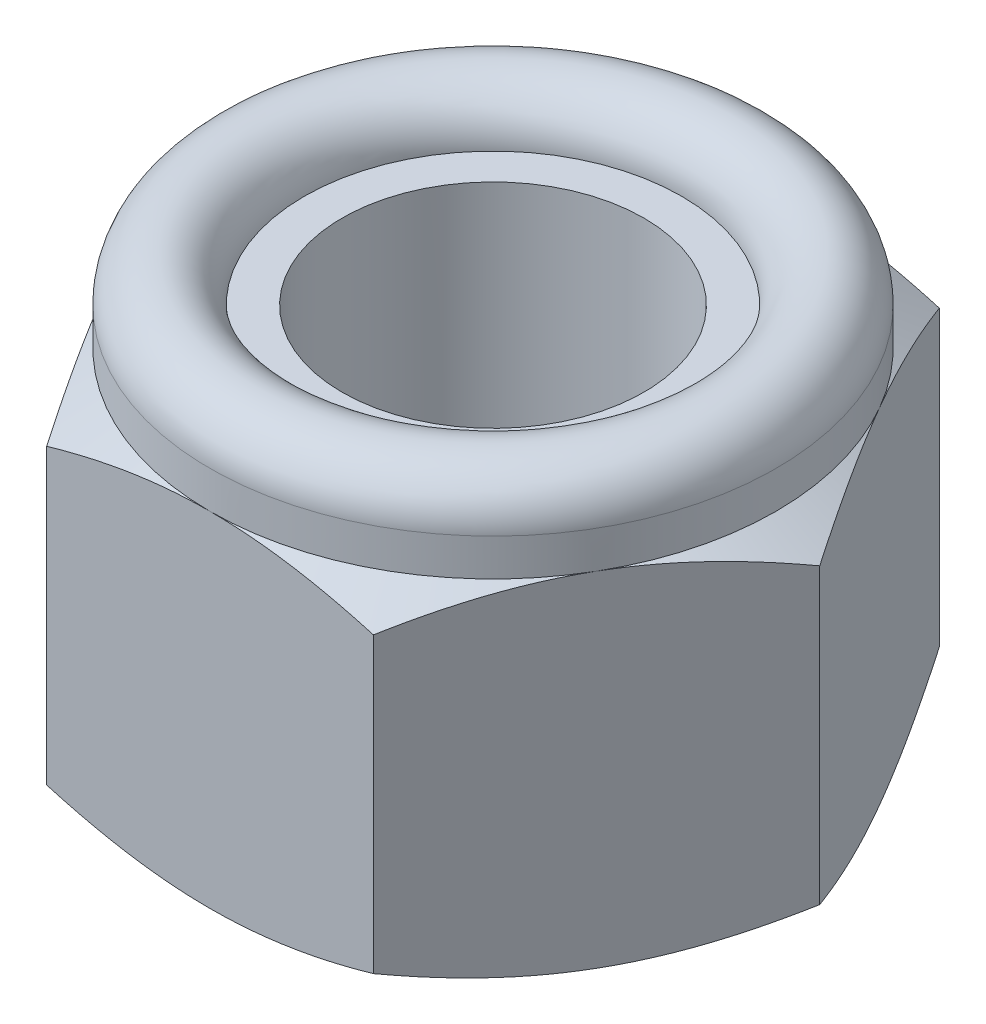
ISO-10303-21;
HEADER;
FILE_DESCRIPTION(('STEP AP214'),'2;1');
FILE_NAME('part.step','',(''),(''),'','','');
FILE_SCHEMA(('AUTOMOTIVE_DESIGN { 1 0 10303 214 1 1 1 1 }'));
ENDSEC;
DATA;
#1=APPLICATION_CONTEXT('core data for automotive mechanical design processes');
#2=APPLICATION_PROTOCOL_DEFINITION('international standard','automotive_design',2000,#1);
#3=PRODUCT_CONTEXT('',#1,'mechanical');
#4=PRODUCT('Part','Part','',(#3));
#5=PRODUCT_RELATED_PRODUCT_CATEGORY('part','',(#4));
#6=PRODUCT_DEFINITION_FORMATION('','',#4);
#7=PRODUCT_DEFINITION_CONTEXT('part definition',#1,'design');
#8=PRODUCT_DEFINITION('design','',#6,#7);
#9=PRODUCT_DEFINITION_SHAPE('','',#8);
#10=(LENGTH_UNIT() NAMED_UNIT(*) SI_UNIT(.MILLI.,.METRE.));
#11=(NAMED_UNIT(*) PLANE_ANGLE_UNIT() SI_UNIT($,.RADIAN.));
#12=(NAMED_UNIT(*) SI_UNIT($,.STERADIAN.) SOLID_ANGLE_UNIT());
#13=UNCERTAINTY_MEASURE_WITH_UNIT(LENGTH_MEASURE(1.E-05),#10,'distance_accuracy_value','');
#14=(GEOMETRIC_REPRESENTATION_CONTEXT(3) GLOBAL_UNCERTAINTY_ASSIGNED_CONTEXT((#13)) GLOBAL_UNIT_ASSIGNED_CONTEXT((#10,
#11,#12)) REPRESENTATION_CONTEXT('',''));
#15=CARTESIAN_POINT('',(0.,0.,0.));
#16=DIRECTION('',(0.,0.,1.));
#17=DIRECTION('',(1.,0.,0.));
#18=AXIS2_PLACEMENT_3D('',#15,#16,#17);
#19=CARTESIAN_POINT('',(0.,0.,0.));
#20=DIRECTION('',(0.,1.,0.));
#21=DIRECTION('',(0.,0.,1.));
#22=AXIS2_PLACEMENT_3D('',#19,#20,#21);
#23=CONICAL_SURFACE('',#22,15.0000000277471,1.04719754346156);
#24=CARTESIAN_POINT('',(17.3206235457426,1.33981263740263,0.0002));
#25=CARTESIAN_POINT('',(17.1302745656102,1.22992179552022,-0.329494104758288));
#26=CARTESIAN_POINT('',(16.9391831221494,1.12501759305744,-0.660474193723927));
#27=CARTESIAN_POINT('',(16.5554679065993,0.926568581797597,-1.32508844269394));
#28=CARTESIAN_POINT('',(16.3628436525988,0.833027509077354,-1.65872343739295));
#29=CARTESIAN_POINT('',(15.975690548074,0.658562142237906,-2.32929228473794));
#30=CARTESIAN_POINT('',(15.781158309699,0.57766769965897,-2.66623200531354));
#31=CARTESIAN_POINT('',(15.3907420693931,0.430232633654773,-3.34245276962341));
#32=CARTESIAN_POINT('',(15.194858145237,0.363691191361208,-3.6817336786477));
#33=CARTESIAN_POINT('',(14.8067578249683,0.247792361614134,-4.3539431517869));
#34=CARTESIAN_POINT('',(14.6145702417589,0.198051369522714,-4.68682181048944));
#35=CARTESIAN_POINT('',(14.229314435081,0.114646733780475,-5.35410444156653));
#36=CARTESIAN_POINT('',(14.0362461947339,0.0809833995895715,-5.68850844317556));
#37=CARTESIAN_POINT('',(13.6497853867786,0.0305840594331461,-6.35787819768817));
#38=CARTESIAN_POINT('',(13.4563934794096,0.0138279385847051,-6.692842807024));
#39=CARTESIAN_POINT('',(13.0694311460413,-0.0023966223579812,-7.36308122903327));
#40=CARTESIAN_POINT('',(12.875860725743,-0.00186559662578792,-7.69835503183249));
#41=CARTESIAN_POINT('',(12.513982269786,0.0152765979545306,-8.3251469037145));
#42=CARTESIAN_POINT('',(12.3456484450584,0.0297968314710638,-8.61670964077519));
#43=CARTESIAN_POINT('',(12.0093680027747,0.0716371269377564,-9.19916445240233));
#44=CARTESIAN_POINT('',(11.8414214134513,0.098958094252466,-9.49005647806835));
#45=CARTESIAN_POINT('',(11.5060066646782,0.165923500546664,-10.0710118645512));
#46=CARTESIAN_POINT('',(11.3385390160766,0.205578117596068,-10.3610743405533));
#47=CARTESIAN_POINT('',(11.0043888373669,0.296515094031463,-10.9398394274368));
#48=CARTESIAN_POINT('',(10.8377063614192,0.347798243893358,-11.2285419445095));
#49=CARTESIAN_POINT('',(10.3317324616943,0.520386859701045,-12.1049144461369));
#50=CARTESIAN_POINT('',(9.99390625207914,0.658901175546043,-12.6900466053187));
#51=CARTESIAN_POINT('',(9.32329121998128,0.97327197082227,-13.8515859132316));
#52=CARTESIAN_POINT('',(8.99049381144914,1.14905461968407,-14.4280079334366));
#53=CARTESIAN_POINT('',(8.66013856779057,1.33981263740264,-15.0002));
#54=B_SPLINE_CURVE_WITH_KNOTS('',3,(#24,#25,#26,#27,#28,#29,#30,#31,#32,#33,#34,#35,#36,#37,#38,
#39,#40,#41,#42,#43,#44,#45,#46,#47,#48,#49,#50,#51,#52,#53),.UNSPECIFIED.,.F.,.F.,(4,2,2,2,2,2,
2,2,2,2,2,2,2,2,4),(0.,1.18875411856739,2.37789803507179,3.56980779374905,4.76164953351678,
5.92407381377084,7.08652046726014,8.24758249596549,9.40860864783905,10.4193068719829,
11.4300765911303,12.4416826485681,13.4533574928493,15.5211962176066,17.5849760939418),.UNSPECIFIED.);
#55=CARTESIAN_POINT('',(17.3205080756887,1.33974597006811,0.));
#56=VERTEX_POINT('',#55);
#57=CARTESIAN_POINT('',(12.9903810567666,0.,-7.49999999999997));
#58=VERTEX_POINT('',#57);
#59=EDGE_CURVE('E240',#56,#58,#54,.T.);
#60=ORIENTED_EDGE('',*,*,#59,.F.);
#61=CARTESIAN_POINT('',(8.66013856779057,1.33981263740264,15.0002));
#62=CARTESIAN_POINT('',(8.850487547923,1.22992179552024,14.6705058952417));
#63=CARTESIAN_POINT('',(9.04157899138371,1.12501759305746,14.3395258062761));
#64=CARTESIAN_POINT('',(9.42529420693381,0.926568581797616,13.6749115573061));
#65=CARTESIAN_POINT('',(9.61791846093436,0.833027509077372,13.341276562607));
#66=CARTESIAN_POINT('',(10.0050715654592,0.658562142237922,12.6707077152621));
#67=CARTESIAN_POINT('',(10.1996038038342,0.577667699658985,12.3337679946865));
#68=CARTESIAN_POINT('',(10.5900200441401,0.430232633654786,11.6575472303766));
#69=CARTESIAN_POINT('',(10.7859039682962,0.363691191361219,11.3182663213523));
#70=CARTESIAN_POINT('',(11.1740042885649,0.247792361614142,10.6460568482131));
#71=CARTESIAN_POINT('',(11.3661918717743,0.198051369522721,10.3131781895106));
#72=CARTESIAN_POINT('',(11.7514476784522,0.114646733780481,9.64589555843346));
#73=CARTESIAN_POINT('',(11.9445159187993,0.0809833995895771,9.31149155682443));
#74=CARTESIAN_POINT('',(12.3309767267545,0.03058405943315,8.64212180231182));
#75=CARTESIAN_POINT('',(12.5243686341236,0.0138279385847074,8.30715719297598));
#76=CARTESIAN_POINT('',(12.9113309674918,-0.00239662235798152,7.63691877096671));
#77=CARTESIAN_POINT('',(13.1049013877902,-0.00186559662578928,7.30164496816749));
#78=CARTESIAN_POINT('',(13.4667798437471,0.0152765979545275,6.67485309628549));
#79=CARTESIAN_POINT('',(13.6351136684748,0.0297968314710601,6.3832903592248));
#80=CARTESIAN_POINT('',(13.9713941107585,0.0716371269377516,5.80083554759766));
#81=CARTESIAN_POINT('',(14.1393407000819,0.0989580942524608,5.50994352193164));
#82=CARTESIAN_POINT('',(14.474755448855,0.165923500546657,4.92898813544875));
#83=CARTESIAN_POINT('',(14.6422230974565,0.20557811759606,4.63892565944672));
#84=CARTESIAN_POINT('',(14.9763732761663,0.296515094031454,4.0601605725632));
#85=CARTESIAN_POINT('',(15.1430557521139,0.347798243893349,3.77145805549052));
#86=CARTESIAN_POINT('',(15.6490296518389,0.520386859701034,2.8950855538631));
#87=CARTESIAN_POINT('',(15.986855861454,0.658901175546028,2.30995339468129));
#88=CARTESIAN_POINT('',(16.6574708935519,0.97327197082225,1.14841408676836));
#89=CARTESIAN_POINT('',(16.990268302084,1.14905461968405,0.571992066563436));
#90=CARTESIAN_POINT('',(17.3206235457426,1.33981263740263,-0.000199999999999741));
#91=B_SPLINE_CURVE_WITH_KNOTS('',3,(#61,#62,#63,#64,#65,#66,#67,#68,#69,#70,#71,#72,#73,#74,#75,
#76,#77,#78,#79,#80,#81,#82,#83,#84,#85,#86,#87,#88,#89,#90),.UNSPECIFIED.,.F.,.F.,(4,2,2,2,2,2,
2,2,2,2,2,2,2,2,4),(0.,1.18875411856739,2.3778980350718,3.56980779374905,4.76164953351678,
5.92407381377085,7.08652046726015,8.24758249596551,9.40860864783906,10.4193068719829,
11.4300765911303,12.4416826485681,13.4533574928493,15.5211962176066,17.5849760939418),.UNSPECIFIED.);
#92=CARTESIAN_POINT('',(12.9903810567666,0.,7.49999999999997));
#93=VERTEX_POINT('',#92);
#94=EDGE_CURVE('E155',#93,#56,#91,.T.);
#95=ORIENTED_EDGE('',*,*,#94,.F.);
#96=CARTESIAN_POINT('',(0.,0.,0.));
#97=DIRECTION('',(0.,-1.,0.));
#98=DIRECTION('',(0.,0.,-1.));
#99=AXIS2_PLACEMENT_3D('',#96,#97,#98);
#100=CIRCLE('',#99,15.0000000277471);
#101=EDGE_CURVE('E253',#58,#93,#100,.T.);
#102=ORIENTED_EDGE('',*,*,#101,.F.);
#103=EDGE_LOOP('',(#60,#95,#102));
#104=FACE_BOUND('',#103,.T.);
#105=ADVANCED_FACE('F37',(#104),#23,.T.);
#106=CARTESIAN_POINT('',(8.66025403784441,1.33974597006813,-15.));
#107=VERTEX_POINT('',#106);
#108=EDGE_CURVE('E235',#58,#107,#54,.T.);
#109=ORIENTED_EDGE('',*,*,#108,.F.);
#110=CARTESIAN_POINT('',(0.,0.,-15.));
#111=VERTEX_POINT('',#110);
#112=EDGE_CURVE('E251',#111,#58,#100,.T.);
#113=ORIENTED_EDGE('',*,*,#112,.F.);
#114=CARTESIAN_POINT('',(-23.2814633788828,7.32960262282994,-15.));
#115=CARTESIAN_POINT('',(-22.9538281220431,7.17059187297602,-15.));
#116=CARTESIAN_POINT('',(-22.6258089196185,7.01237260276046,-15.));
#117=CARTESIAN_POINT('',(-21.9689225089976,6.69769623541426,-15.));
#118=CARTESIAN_POINT('',(-21.6400552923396,6.54123915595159,-15.));
#119=CARTESIAN_POINT('',(-20.6519741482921,6.07473891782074,-15.));
#120=CARTESIAN_POINT('',(-19.9913773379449,5.76761377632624,-15.));
#121=CARTESIAN_POINT('',(-18.6621834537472,5.16134884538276,-15.));
#122=CARTESIAN_POINT('',(-17.9935624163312,4.86226146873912,-15.));
#123=CARTESIAN_POINT('',(-16.6510098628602,4.27629575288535,-15.));
#124=CARTESIAN_POINT('',(-15.9770785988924,3.98941683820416,-15.));
#125=CARTESIAN_POINT('',(-14.6009780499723,3.42208752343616,-15.));
#126=CARTESIAN_POINT('',(-13.898599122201,3.14214298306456,-15.));
#127=CARTESIAN_POINT('',(-12.4856258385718,2.60339423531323,-15.));
#128=CARTESIAN_POINT('',(-11.7750305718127,2.34459239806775,-15.));
#129=CARTESIAN_POINT('',(-10.3458412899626,1.85491328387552,-15.));
#130=CARTESIAN_POINT('',(-9.62726674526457,1.62397963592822,-15.));
#131=CARTESIAN_POINT('',(-8.17974172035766,1.19742176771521,-15.));
#132=CARTESIAN_POINT('',(-7.45079458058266,1.00178644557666,-15.));
#133=CARTESIAN_POINT('',(-6.35149009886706,0.742414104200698,-15.));
#134=CARTESIAN_POINT('',(-5.98508799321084,0.661811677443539,-15.));
#135=CARTESIAN_POINT('',(-5.24977663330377,0.512924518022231,-15.));
#136=CARTESIAN_POINT('',(-4.88086743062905,0.44463953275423,-15.));
#137=CARTESIAN_POINT('',(-4.14079375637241,0.321591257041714,-15.));
#138=CARTESIAN_POINT('',(-3.76962931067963,0.266827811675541,-15.));
#139=CARTESIAN_POINT('',(-3.02543966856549,0.171914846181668,-15.));
#140=CARTESIAN_POINT('',(-2.65241455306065,0.131764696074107,-15.));
#141=CARTESIAN_POINT('',(-1.90990059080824,0.067379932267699,-15.));
#142=CARTESIAN_POINT('',(-1.54042930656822,0.0429440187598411,-15.));
#143=CARTESIAN_POINT('',(-0.800785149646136,0.00971957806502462,-15.));
#144=CARTESIAN_POINT('',(-0.430612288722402,0.000930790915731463,-15.));
#145=CARTESIAN_POINT('',(0.309774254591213,-0.000790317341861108,-15.));
#146=CARTESIAN_POINT('',(0.679987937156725,0.00627743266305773,-15.));
#147=CARTESIAN_POINT('',(1.41978709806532,0.0360968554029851,-15.));
#148=CARTESIAN_POINT('',(1.7893725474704,0.0588492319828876,-15.));
#149=CARTESIAN_POINT('',(2.67703968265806,0.131848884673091,-15.));
#150=CARTESIAN_POINT('',(3.19452269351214,0.189506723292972,-15.));
#151=CARTESIAN_POINT('',(4.22566359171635,0.332436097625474,-15.));
#152=CARTESIAN_POINT('',(4.7393209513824,0.417711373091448,-15.));
#153=CARTESIAN_POINT('',(5.76231610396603,0.612842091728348,-15.));
#154=CARTESIAN_POINT('',(6.27165021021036,0.722716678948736,-15.));
#155=CARTESIAN_POINT('',(7.28521654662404,0.963691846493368,-15.));
#156=CARTESIAN_POINT('',(7.78944885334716,1.09479210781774,-15.));
#157=CARTESIAN_POINT('',(8.80388330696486,1.37812109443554,-15.));
#158=CARTESIAN_POINT('',(9.31397250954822,1.53075141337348,-15.));
#159=CARTESIAN_POINT('',(10.3291263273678,1.85181061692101,-15.));
#160=CARTESIAN_POINT('',(10.8341909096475,2.02023960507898,-15.));
#161=CARTESIAN_POINT('',(11.8395443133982,2.37021940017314,-15.));
#162=CARTESIAN_POINT('',(12.3398346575,2.55176585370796,-15.));
#163=CARTESIAN_POINT('',(13.336268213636,2.92584198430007,-15.));
#164=CARTESIAN_POINT('',(13.8324114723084,3.11837153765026,-15.));
#165=CARTESIAN_POINT('',(14.9951014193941,3.58201061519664,-15.));
#166=CARTESIAN_POINT('',(15.6601315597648,3.85691733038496,-15.));
#167=CARTESIAN_POINT('',(16.9845867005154,4.41995498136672,-15.));
#168=CARTESIAN_POINT('',(17.6440113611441,4.70808671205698,-15.));
#169=CARTESIAN_POINT('',(18.9582875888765,5.29495008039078,-15.));
#170=CARTESIAN_POINT('',(19.6131381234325,5.59368402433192,-15.));
#171=CARTESIAN_POINT('',(20.918877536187,6.19963236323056,-15.));
#172=CARTESIAN_POINT('',(21.5697664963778,6.5068465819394,-15.));
#173=CARTESIAN_POINT('',(22.8689333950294,7.12851763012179,-15.));
#174=CARTESIAN_POINT('',(23.5172077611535,7.44298191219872,-15.));
#175=CARTESIAN_POINT('',(24.8109635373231,8.0776031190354,-15.));
#176=CARTESIAN_POINT('',(25.4564449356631,8.39776006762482,-15.));
#177=CARTESIAN_POINT('',(26.7449591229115,9.04275717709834,-15.));
#178=CARTESIAN_POINT('',(27.3879922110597,9.36759674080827,-15.));
#179=CARTESIAN_POINT('',(28.6720425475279,10.0212380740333,-15.));
#180=CARTESIAN_POINT('',(29.3130597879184,10.3500398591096,-15.));
#181=CARTESIAN_POINT('',(31.1273189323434,11.2866142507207,-15.));
#182=CARTESIAN_POINT('',(32.2985274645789,11.8983257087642,-15.));
#183=CARTESIAN_POINT('',(34.6365647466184,13.1301397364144,-15.));
#184=CARTESIAN_POINT('',(35.8033933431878,13.7502425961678,-15.));
#185=CARTESIAN_POINT('',(38.1307380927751,14.9953464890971,-15.));
#186=CARTESIAN_POINT('',(39.2912627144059,15.6203317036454,-15.));
#187=CARTESIAN_POINT('',(41.0299793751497,16.5615543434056,-15.));
#188=CARTESIAN_POINT('',(41.6091911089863,16.8759109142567,-15.));
#189=CARTESIAN_POINT('',(42.7670021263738,17.5057478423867,-15.));
#190=CARTESIAN_POINT('',(43.3456014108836,17.8212281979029,-15.));
#191=CARTESIAN_POINT('',(43.9239290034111,18.1372059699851,-15.));
#192=B_SPLINE_CURVE_WITH_KNOTS('',3,(#114,#115,#116,#117,#118,#119,#120,#121,#122,#123,#124,
#125,#126,#127,#128,#129,#130,#131,#132,#133,#134,#135,#136,#137,#138,#139,#140,#141,#142,#143,
#144,#145,#146,#147,#148,#149,#150,#151,#152,#153,#154,#155,#156,#157,#158,#159,#160,#161,#162,
#163,#164,#165,#166,#167,#168,#169,#170,#171,#172,#173,#174,#175,#176,#177,#178,#179,#180,#181,
#182,#183,#184,#185,#186,#187,#188,#189,#190,#191),.UNSPECIFIED.,.F.,.F.,(4,2,2,2,2,2,2,2,2,2,2,
2,2,2,2,2,2,2,2,2,2,2,2,2,2,2,2,2,2,2,2,2,2,2,2,2,2,2,4),(0.,1.09254711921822,2.18510518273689,
4.37054362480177,6.5678483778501,8.76504944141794,11.0331250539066,13.3014545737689,
15.565116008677,17.8280642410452,18.9533795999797,20.0786718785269,21.2039512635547,
22.3291821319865,23.439695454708,24.5501903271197,25.6606901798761,26.7712398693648,
28.3324320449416,29.8938357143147,31.4564587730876,33.0190583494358,34.6160574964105,
36.213067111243,37.8095491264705,39.4060131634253,41.5646504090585,43.723417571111,
45.8826572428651,48.0418520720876,50.2033751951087,52.3649073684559,54.5261662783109,
56.6874336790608,60.6513806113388,64.6154649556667,68.5697894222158,70.5468460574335,
72.5238995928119),.UNSPECIFIED.);
#193=EDGE_CURVE('E341',#107,#111,#192,.F.);
#194=ORIENTED_EDGE('',*,*,#193,.F.);
#195=EDGE_LOOP('',(#109,#113,#194));
#196=FACE_BOUND('',#195,.T.);
#197=ADVANCED_FACE('F271',(#196),#23,.T.);
#198=CARTESIAN_POINT('',(-8.66025403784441,1.33974597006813,-15.));
#199=VERTEX_POINT('',#198);
#200=EDGE_CURVE('E212',#111,#199,#192,.F.);
#201=ORIENTED_EDGE('',*,*,#200,.F.);
#202=CARTESIAN_POINT('',(-12.9903810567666,0.,-7.49999999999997));
#203=VERTEX_POINT('',#202);
#204=EDGE_CURVE('E249',#203,#111,#100,.T.);
#205=ORIENTED_EDGE('',*,*,#204,.F.);
#206=CARTESIAN_POINT('',(-8.66013856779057,1.33981263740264,-15.0002));
#207=CARTESIAN_POINT('',(-8.850487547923,1.22992179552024,-14.6705058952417));
#208=CARTESIAN_POINT('',(-9.04157899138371,1.12501759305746,-14.3395258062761));
#209=CARTESIAN_POINT('',(-9.42529420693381,0.926568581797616,-13.6749115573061));
#210=CARTESIAN_POINT('',(-9.61791846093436,0.833027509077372,-13.341276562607));
#211=CARTESIAN_POINT('',(-10.0050715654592,0.658562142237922,-12.6707077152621));
#212=CARTESIAN_POINT('',(-10.1996038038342,0.577667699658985,-12.3337679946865));
#213=CARTESIAN_POINT('',(-10.5900200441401,0.430232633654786,-11.6575472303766));
#214=CARTESIAN_POINT('',(-10.7859039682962,0.363691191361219,-11.3182663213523));
#215=CARTESIAN_POINT('',(-11.1740042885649,0.247792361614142,-10.6460568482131));
#216=CARTESIAN_POINT('',(-11.3661918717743,0.198051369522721,-10.3131781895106));
#217=CARTESIAN_POINT('',(-11.7514476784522,0.114646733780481,-9.64589555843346));
#218=CARTESIAN_POINT('',(-11.9445159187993,0.0809833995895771,-9.31149155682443));
#219=CARTESIAN_POINT('',(-12.3309767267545,0.03058405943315,-8.64212180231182));
#220=CARTESIAN_POINT('',(-12.5243686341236,0.0138279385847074,-8.30715719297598));
#221=CARTESIAN_POINT('',(-12.9113309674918,-0.00239662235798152,-7.63691877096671));
#222=CARTESIAN_POINT('',(-13.1049013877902,-0.00186559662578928,-7.30164496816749));
#223=CARTESIAN_POINT('',(-13.4667798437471,0.0152765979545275,-6.67485309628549));
#224=CARTESIAN_POINT('',(-13.6351136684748,0.0297968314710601,-6.3832903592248));
#225=CARTESIAN_POINT('',(-13.9713941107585,0.0716371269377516,-5.80083554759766));
#226=CARTESIAN_POINT('',(-14.1393407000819,0.0989580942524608,-5.50994352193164));
#227=CARTESIAN_POINT('',(-14.474755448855,0.165923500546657,-4.92898813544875));
#228=CARTESIAN_POINT('',(-14.6422230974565,0.20557811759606,-4.63892565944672));
#229=CARTESIAN_POINT('',(-14.9763732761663,0.296515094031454,-4.0601605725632));
#230=CARTESIAN_POINT('',(-15.1430557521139,0.347798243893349,-3.77145805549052));
#231=CARTESIAN_POINT('',(-15.6490296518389,0.520386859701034,-2.8950855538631));
#232=CARTESIAN_POINT('',(-15.986855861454,0.658901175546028,-2.30995339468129));
#233=CARTESIAN_POINT('',(-16.6574708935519,0.97327197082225,-1.14841408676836));
#234=CARTESIAN_POINT('',(-16.990268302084,1.14905461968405,-0.571992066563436));
#235=CARTESIAN_POINT('',(-17.3206235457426,1.33981263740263,0.000199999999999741));
#236=B_SPLINE_CURVE_WITH_KNOTS('',3,(#206,#207,#208,#209,#210,#211,#212,#213,#214,#215,#216,
#217,#218,#219,#220,#221,#222,#223,#224,#225,#226,#227,#228,#229,#230,#231,#232,#233,#234,#235),
.UNSPECIFIED.,.F.,.F.,(4,2,2,2,2,2,2,2,2,2,2,2,2,2,4),(0.,1.18875411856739,2.3778980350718,
3.56980779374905,4.76164953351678,5.92407381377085,7.08652046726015,8.24758249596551,
9.40860864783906,10.4193068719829,11.4300765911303,12.4416826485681,13.4533574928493,
15.5211962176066,17.5849760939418),.UNSPECIFIED.);
#237=EDGE_CURVE('E207',#199,#203,#236,.T.);
#238=ORIENTED_EDGE('',*,*,#237,.F.);
#239=EDGE_LOOP('',(#201,#205,#238));
#240=FACE_BOUND('',#239,.T.);
#241=ADVANCED_FACE('F276',(#240),#23,.T.);
#242=CARTESIAN_POINT('',(-17.3205080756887,1.33974597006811,0.));
#243=VERTEX_POINT('',#242);
#244=EDGE_CURVE('E208',#203,#243,#236,.T.);
#245=ORIENTED_EDGE('',*,*,#244,.F.);
#246=CARTESIAN_POINT('',(-12.9903810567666,0.,7.49999999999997));
#247=VERTEX_POINT('',#246);
#248=EDGE_CURVE('E313',#247,#203,#100,.T.);
#249=ORIENTED_EDGE('',*,*,#248,.F.);
#250=CARTESIAN_POINT('',(-17.3206235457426,1.33981263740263,-0.0002));
#251=CARTESIAN_POINT('',(-17.1302745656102,1.22992179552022,0.329494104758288));
#252=CARTESIAN_POINT('',(-16.9391831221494,1.12501759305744,0.660474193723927));
#253=CARTESIAN_POINT('',(-16.5554679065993,0.926568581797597,1.32508844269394));
#254=CARTESIAN_POINT('',(-16.3628436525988,0.833027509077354,1.65872343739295));
#255=CARTESIAN_POINT('',(-15.975690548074,0.658562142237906,2.32929228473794));
#256=CARTESIAN_POINT('',(-15.781158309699,0.57766769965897,2.66623200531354));
#257=CARTESIAN_POINT('',(-15.3907420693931,0.430232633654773,3.34245276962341));
#258=CARTESIAN_POINT('',(-15.194858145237,0.363691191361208,3.6817336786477));
#259=CARTESIAN_POINT('',(-14.8067578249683,0.247792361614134,4.3539431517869));
#260=CARTESIAN_POINT('',(-14.6145702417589,0.198051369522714,4.68682181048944));
#261=CARTESIAN_POINT('',(-14.229314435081,0.114646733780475,5.35410444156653));
#262=CARTESIAN_POINT('',(-14.0362461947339,0.0809833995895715,5.68850844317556));
#263=CARTESIAN_POINT('',(-13.6497853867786,0.0305840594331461,6.35787819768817));
#264=CARTESIAN_POINT('',(-13.4563934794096,0.0138279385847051,6.692842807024));
#265=CARTESIAN_POINT('',(-13.0694311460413,-0.0023966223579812,7.36308122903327));
#266=CARTESIAN_POINT('',(-12.875860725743,-0.00186559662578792,7.69835503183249));
#267=CARTESIAN_POINT('',(-12.513982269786,0.0152765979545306,8.3251469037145));
#268=CARTESIAN_POINT('',(-12.3456484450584,0.0297968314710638,8.61670964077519));
#269=CARTESIAN_POINT('',(-12.0093680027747,0.0716371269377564,9.19916445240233));
#270=CARTESIAN_POINT('',(-11.8414214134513,0.098958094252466,9.49005647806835));
#271=CARTESIAN_POINT('',(-11.5060066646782,0.165923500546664,10.0710118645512));
#272=CARTESIAN_POINT('',(-11.3385390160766,0.205578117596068,10.3610743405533));
#273=CARTESIAN_POINT('',(-11.0043888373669,0.296515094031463,10.9398394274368));
#274=CARTESIAN_POINT('',(-10.8377063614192,0.347798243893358,11.2285419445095));
#275=CARTESIAN_POINT('',(-10.3317324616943,0.520386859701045,12.1049144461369));
#276=CARTESIAN_POINT('',(-9.99390625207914,0.658901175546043,12.6900466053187));
#277=CARTESIAN_POINT('',(-9.32329121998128,0.97327197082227,13.8515859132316));
#278=CARTESIAN_POINT('',(-8.99049381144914,1.14905461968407,14.4280079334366));
#279=CARTESIAN_POINT('',(-8.66013856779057,1.33981263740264,15.0002));
#280=B_SPLINE_CURVE_WITH_KNOTS('',3,(#250,#251,#252,#253,#254,#255,#256,#257,#258,#259,#260,
#261,#262,#263,#264,#265,#266,#267,#268,#269,#270,#271,#272,#273,#274,#275,#276,#277,#278,#279),
.UNSPECIFIED.,.F.,.F.,(4,2,2,2,2,2,2,2,2,2,2,2,2,2,4),(0.,1.18875411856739,2.37789803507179,
3.56980779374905,4.76164953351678,5.92407381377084,7.08652046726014,8.24758249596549,
9.40860864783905,10.4193068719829,11.4300765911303,12.4416826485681,13.4533574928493,
15.5211962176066,17.5849760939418),.UNSPECIFIED.);
#281=EDGE_CURVE('E308',#243,#247,#280,.T.);
#282=ORIENTED_EDGE('',*,*,#281,.F.);
#283=EDGE_LOOP('',(#245,#249,#282));
#284=FACE_BOUND('',#283,.T.);
#285=ADVANCED_FACE('F288',(#284),#23,.T.);
#286=CARTESIAN_POINT('',(-8.66025403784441,1.33974597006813,15.));
#287=VERTEX_POINT('',#286);
#288=EDGE_CURVE('E300',#247,#287,#280,.T.);
#289=ORIENTED_EDGE('',*,*,#288,.F.);
#290=CARTESIAN_POINT('',(0.,0.,15.));
#291=VERTEX_POINT('',#290);
#292=EDGE_CURVE('E303',#291,#247,#100,.T.);
#293=ORIENTED_EDGE('',*,*,#292,.F.);
#294=CARTESIAN_POINT('',(-23.2814633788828,7.32960262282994,15.));
#295=CARTESIAN_POINT('',(-22.9538281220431,7.17059187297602,15.));
#296=CARTESIAN_POINT('',(-22.6258089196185,7.01237260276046,15.));
#297=CARTESIAN_POINT('',(-21.9689225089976,6.69769623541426,15.));
#298=CARTESIAN_POINT('',(-21.6400552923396,6.54123915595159,15.));
#299=CARTESIAN_POINT('',(-20.6519741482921,6.07473891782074,15.));
#300=CARTESIAN_POINT('',(-19.9913773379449,5.76761377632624,15.));
#301=CARTESIAN_POINT('',(-18.6621834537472,5.16134884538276,15.));
#302=CARTESIAN_POINT('',(-17.9935624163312,4.86226146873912,15.));
#303=CARTESIAN_POINT('',(-16.6510098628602,4.27629575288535,15.));
#304=CARTESIAN_POINT('',(-15.9770785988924,3.98941683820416,15.));
#305=CARTESIAN_POINT('',(-14.6009780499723,3.42208752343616,15.));
#306=CARTESIAN_POINT('',(-13.898599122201,3.14214298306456,15.));
#307=CARTESIAN_POINT('',(-12.4856258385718,2.60339423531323,15.));
#308=CARTESIAN_POINT('',(-11.7750305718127,2.34459239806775,15.));
#309=CARTESIAN_POINT('',(-10.3458412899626,1.85491328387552,15.));
#310=CARTESIAN_POINT('',(-9.62726674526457,1.62397963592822,15.));
#311=CARTESIAN_POINT('',(-8.17974172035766,1.19742176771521,15.));
#312=CARTESIAN_POINT('',(-7.45079458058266,1.00178644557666,15.));
#313=CARTESIAN_POINT('',(-6.35149009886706,0.742414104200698,15.));
#314=CARTESIAN_POINT('',(-5.98508799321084,0.661811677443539,15.));
#315=CARTESIAN_POINT('',(-5.24977663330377,0.512924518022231,15.));
#316=CARTESIAN_POINT('',(-4.88086743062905,0.44463953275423,15.));
#317=CARTESIAN_POINT('',(-4.14079375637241,0.321591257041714,15.));
#318=CARTESIAN_POINT('',(-3.76962931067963,0.266827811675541,15.));
#319=CARTESIAN_POINT('',(-3.02543966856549,0.171914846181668,15.));
#320=CARTESIAN_POINT('',(-2.65241455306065,0.131764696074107,15.));
#321=CARTESIAN_POINT('',(-1.90990059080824,0.067379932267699,15.));
#322=CARTESIAN_POINT('',(-1.54042930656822,0.0429440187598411,15.));
#323=CARTESIAN_POINT('',(-0.800785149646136,0.00971957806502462,15.));
#324=CARTESIAN_POINT('',(-0.430612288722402,0.000930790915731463,15.));
#325=CARTESIAN_POINT('',(0.309774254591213,-0.000790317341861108,15.));
#326=CARTESIAN_POINT('',(0.679987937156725,0.00627743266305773,15.));
#327=CARTESIAN_POINT('',(1.41978709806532,0.0360968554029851,15.));
#328=CARTESIAN_POINT('',(1.7893725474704,0.0588492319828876,15.));
#329=CARTESIAN_POINT('',(2.67703968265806,0.131848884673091,15.));
#330=CARTESIAN_POINT('',(3.19452269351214,0.189506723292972,15.));
#331=CARTESIAN_POINT('',(4.22566359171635,0.332436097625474,15.));
#332=CARTESIAN_POINT('',(4.7393209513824,0.417711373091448,15.));
#333=CARTESIAN_POINT('',(5.76231610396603,0.612842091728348,15.));
#334=CARTESIAN_POINT('',(6.27165021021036,0.722716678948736,15.));
#335=CARTESIAN_POINT('',(7.28521654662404,0.963691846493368,15.));
#336=CARTESIAN_POINT('',(7.78944885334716,1.09479210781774,15.));
#337=CARTESIAN_POINT('',(8.80388330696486,1.37812109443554,15.));
#338=CARTESIAN_POINT('',(9.31397250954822,1.53075141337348,15.));
#339=CARTESIAN_POINT('',(10.3291263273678,1.85181061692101,15.));
#340=CARTESIAN_POINT('',(10.8341909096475,2.02023960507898,15.));
#341=CARTESIAN_POINT('',(11.8395443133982,2.37021940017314,15.));
#342=CARTESIAN_POINT('',(12.3398346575,2.55176585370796,15.));
#343=CARTESIAN_POINT('',(13.336268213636,2.92584198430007,15.));
#344=CARTESIAN_POINT('',(13.8324114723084,3.11837153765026,15.));
#345=CARTESIAN_POINT('',(14.9951014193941,3.58201061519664,15.));
#346=CARTESIAN_POINT('',(15.6601315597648,3.85691733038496,15.));
#347=CARTESIAN_POINT('',(16.9845867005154,4.41995498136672,15.));
#348=CARTESIAN_POINT('',(17.6440113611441,4.70808671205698,15.));
#349=CARTESIAN_POINT('',(18.9582875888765,5.29495008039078,15.));
#350=CARTESIAN_POINT('',(19.6131381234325,5.59368402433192,15.));
#351=CARTESIAN_POINT('',(20.918877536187,6.19963236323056,15.));
#352=CARTESIAN_POINT('',(21.5697664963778,6.5068465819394,15.));
#353=CARTESIAN_POINT('',(22.8689333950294,7.12851763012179,15.));
#354=CARTESIAN_POINT('',(23.5172077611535,7.44298191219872,15.));
#355=CARTESIAN_POINT('',(24.8109635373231,8.0776031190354,15.));
#356=CARTESIAN_POINT('',(25.4564449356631,8.39776006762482,15.));
#357=CARTESIAN_POINT('',(26.7449591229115,9.04275717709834,15.));
#358=CARTESIAN_POINT('',(27.3879922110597,9.36759674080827,15.));
#359=CARTESIAN_POINT('',(28.6720425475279,10.0212380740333,15.));
#360=CARTESIAN_POINT('',(29.3130597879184,10.3500398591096,15.));
#361=CARTESIAN_POINT('',(31.1273189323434,11.2866142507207,15.));
#362=CARTESIAN_POINT('',(32.2985274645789,11.8983257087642,15.));
#363=CARTESIAN_POINT('',(34.6365647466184,13.1301397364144,15.));
#364=CARTESIAN_POINT('',(35.8033933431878,13.7502425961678,15.));
#365=CARTESIAN_POINT('',(38.1307380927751,14.9953464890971,15.));
#366=CARTESIAN_POINT('',(39.2912627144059,15.6203317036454,15.));
#367=CARTESIAN_POINT('',(41.0299793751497,16.5615543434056,15.));
#368=CARTESIAN_POINT('',(41.6091911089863,16.8759109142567,15.));
#369=CARTESIAN_POINT('',(42.7670021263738,17.5057478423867,15.));
#370=CARTESIAN_POINT('',(43.3456014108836,17.8212281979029,15.));
#371=CARTESIAN_POINT('',(43.9239290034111,18.1372059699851,15.));
#372=B_SPLINE_CURVE_WITH_KNOTS('',3,(#294,#295,#296,#297,#298,#299,#300,#301,#302,#303,#304,
#305,#306,#307,#308,#309,#310,#311,#312,#313,#314,#315,#316,#317,#318,#319,#320,#321,#322,#323,
#324,#325,#326,#327,#328,#329,#330,#331,#332,#333,#334,#335,#336,#337,#338,#339,#340,#341,#342,
#343,#344,#345,#346,#347,#348,#349,#350,#351,#352,#353,#354,#355,#356,#357,#358,#359,#360,#361,
#362,#363,#364,#365,#366,#367,#368,#369,#370,#371),.UNSPECIFIED.,.F.,.F.,(4,2,2,2,2,2,2,2,2,2,2,
2,2,2,2,2,2,2,2,2,2,2,2,2,2,2,2,2,2,2,2,2,2,2,2,2,2,2,4),(0.,1.09254711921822,2.18510518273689,
4.37054362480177,6.5678483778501,8.76504944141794,11.0331250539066,13.3014545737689,
15.565116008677,17.8280642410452,18.9533795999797,20.0786718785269,21.2039512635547,
22.3291821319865,23.439695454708,24.5501903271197,25.6606901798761,26.7712398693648,
28.3324320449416,29.8938357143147,31.4564587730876,33.0190583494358,34.6160574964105,
36.213067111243,37.8095491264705,39.4060131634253,41.5646504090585,43.723417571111,
45.8826572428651,48.0418520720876,50.2033751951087,52.3649073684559,54.5261662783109,
56.6874336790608,60.6513806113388,64.6154649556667,68.5697894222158,70.5468460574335,
72.5238995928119),.UNSPECIFIED.);
#373=EDGE_CURVE('E147',#287,#291,#372,.T.);
#374=ORIENTED_EDGE('',*,*,#373,.F.);
#375=EDGE_LOOP('',(#289,#293,#374));
#376=FACE_BOUND('',#375,.T.);
#377=ADVANCED_FACE('F282',(#376),#23,.T.);
#378=CARTESIAN_POINT('',(0.,14.6451612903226,0.));
#379=DIRECTION('',(0.,-1.,0.));
#380=DIRECTION('',(0.,0.,-1.));
#381=AXIS2_PLACEMENT_3D('',#378,#379,#380);
#382=CONICAL_SURFACE('',#381,21.2132034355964,1.04719755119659);
#383=CARTESIAN_POINT('',(-17.3206235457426,16.8925433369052,0.0002));
#384=CARTESIAN_POINT('',(-17.130274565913,17.0024341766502,-0.3294941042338));
#385=CARTESIAN_POINT('',(-16.939183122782,17.1073383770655,-0.6604741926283));
#386=CARTESIAN_POINT('',(-16.5554679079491,17.305787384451,-1.32508844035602));
#387=CARTESIAN_POINT('',(-16.3628436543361,17.3993284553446,-1.6587234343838));
#388=CARTESIAN_POINT('',(-15.9756905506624,17.5737938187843,-2.32929228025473));
#389=CARTESIAN_POINT('',(-15.7811583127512,17.6546882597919,-2.66623200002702));
#390=CARTESIAN_POINT('',(-15.3907420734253,17.8021233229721,-3.34245276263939));
#391=CARTESIAN_POINT('',(-15.1948581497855,17.8686647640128,-3.68173367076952));
#392=CARTESIAN_POINT('',(-14.8067578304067,17.9845635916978,-4.35394314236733));
#393=CARTESIAN_POINT('',(-14.6145702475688,18.0343045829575,-4.68682180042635));
#394=CARTESIAN_POINT('',(-14.2293144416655,18.1177092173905,-5.35410443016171));
#395=CARTESIAN_POINT('',(-14.0362462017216,18.151372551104,-5.68850843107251));
#396=CARTESIAN_POINT('',(-13.6497853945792,18.201771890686,-6.35787818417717));
#397=CARTESIAN_POINT('',(-13.4563934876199,18.2185280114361,-6.69284279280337));
#398=CARTESIAN_POINT('',(-13.0694311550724,18.2347525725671,-7.36308121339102));
#399=CARTESIAN_POINT('',(-12.8758607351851,18.2342215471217,-7.69835501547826));
#400=CARTESIAN_POINT('',(-12.5139822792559,18.217079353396,-8.32514688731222));
#401=CARTESIAN_POINT('',(-12.3456484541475,18.2025591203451,-8.61670962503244));
#402=CARTESIAN_POINT('',(-12.0093680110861,18.1607188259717,-9.1991644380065));
#403=CARTESIAN_POINT('',(-11.8414214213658,18.1333978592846,-9.4900564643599));
#404=CARTESIAN_POINT('',(-11.5060066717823,18.0664324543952,-10.0710118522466));
#405=CARTESIAN_POINT('',(-11.338539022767,18.0267778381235,-10.3610743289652));
#406=CARTESIAN_POINT('',(-11.0043888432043,17.9358408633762,-10.939839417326));
#407=CARTESIAN_POINT('',(-10.8377063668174,17.8845577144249,-11.2285419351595));
#408=CARTESIAN_POINT('',(-10.3317324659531,17.711969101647,-12.1049144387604));
#409=CARTESIAN_POINT('',(-9.99390625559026,17.5734547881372,-12.6900465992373));
#410=CARTESIAN_POINT('',(-9.32329122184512,17.2590839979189,-13.8515859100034));
#411=CARTESIAN_POINT('',(-8.99049381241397,17.0833013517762,-14.4280079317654));
#412=CARTESIAN_POINT('',(-8.66013856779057,16.8925433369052,-15.0002));
#413=B_SPLINE_CURVE_WITH_KNOTS('',3,(#383,#384,#385,#386,#387,#388,#389,#390,#391,#392,#393,
#394,#395,#396,#397,#398,#399,#400,#401,#402,#403,#404,#405,#406,#407,#408,#409,#410,#411,#412),
.UNSPECIFIED.,.F.,.F.,(4,2,2,2,2,2,2,2,2,2,2,2,2,2,4),(0.,1.18875411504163,2.37789802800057,
3.56980778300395,4.76164951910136,5.92407379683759,7.08652044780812,8.24758247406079,
9.40860862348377,10.4193068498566,11.4300765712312,12.4416826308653,13.4533574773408,
15.5211962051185,17.584976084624),.UNSPECIFIED.);
#414=CARTESIAN_POINT('',(-17.3205080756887,16.8926100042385,0.));
#415=VERTEX_POINT('',#414);
#416=CARTESIAN_POINT('',(-12.9903810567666,18.2323559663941,-7.49999999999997));
#417=VERTEX_POINT('',#416);
#418=EDGE_CURVE('E368',#415,#417,#413,.T.);
#419=ORIENTED_EDGE('',*,*,#418,.F.);
#420=CARTESIAN_POINT('',(-8.66013856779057,16.8925433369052,15.0002));
#421=CARTESIAN_POINT('',(-8.85048754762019,17.0024341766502,14.6705058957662));
#422=CARTESIAN_POINT('',(-9.04157899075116,17.1073383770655,14.3395258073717));
#423=CARTESIAN_POINT('',(-9.42529420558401,17.305787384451,13.674911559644));
#424=CARTESIAN_POINT('',(-9.61791845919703,17.3993284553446,13.3412765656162));
#425=CARTESIAN_POINT('',(-10.0050715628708,17.5737938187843,12.6707077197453));
#426=CARTESIAN_POINT('',(-10.199603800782,17.6546882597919,12.333767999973));
#427=CARTESIAN_POINT('',(-10.5900200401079,17.8021233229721,11.6575472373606));
#428=CARTESIAN_POINT('',(-10.7859039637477,17.8686647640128,11.3182663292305));
#429=CARTESIAN_POINT('',(-11.1740042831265,17.9845635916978,10.6460568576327));
#430=CARTESIAN_POINT('',(-11.3661918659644,18.0343045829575,10.3131781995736));
#431=CARTESIAN_POINT('',(-11.7514476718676,18.1177092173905,9.64589556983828));
#432=CARTESIAN_POINT('',(-11.9445159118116,18.151372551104,9.31149156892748));
#433=CARTESIAN_POINT('',(-12.3309767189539,18.201771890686,8.64212181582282));
#434=CARTESIAN_POINT('',(-12.5243686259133,18.2185280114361,8.30715720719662));
#435=CARTESIAN_POINT('',(-12.9113309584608,18.2347525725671,7.63691878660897));
#436=CARTESIAN_POINT('',(-13.1049013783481,18.2342215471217,7.30164498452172));
#437=CARTESIAN_POINT('',(-13.4667798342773,18.217079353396,6.67485311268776));
#438=CARTESIAN_POINT('',(-13.6351136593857,18.2025591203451,6.38329037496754));
#439=CARTESIAN_POINT('',(-13.9713941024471,18.1607188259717,5.80083556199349));
#440=CARTESIAN_POINT('',(-14.1393406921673,18.1333978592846,5.50994353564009));
#441=CARTESIAN_POINT('',(-14.4747554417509,18.0664324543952,4.92898814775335));
#442=CARTESIAN_POINT('',(-14.6422230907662,18.0267778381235,4.63892567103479));
#443=CARTESIAN_POINT('',(-14.9763732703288,17.9358408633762,4.06016058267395));
#444=CARTESIAN_POINT('',(-15.1430557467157,17.8845577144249,3.77145806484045));
#445=CARTESIAN_POINT('',(-15.6490296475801,17.711969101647,2.89508556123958));
#446=CARTESIAN_POINT('',(-15.9868558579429,17.5734547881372,2.30995340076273));
#447=CARTESIAN_POINT('',(-16.657470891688,17.2590839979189,1.14841408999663));
#448=CARTESIAN_POINT('',(-16.9902683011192,17.0833013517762,0.571992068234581));
#449=CARTESIAN_POINT('',(-17.3206235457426,16.8925433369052,-0.000200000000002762));
#450=B_SPLINE_CURVE_WITH_KNOTS('',3,(#420,#421,#422,#423,#424,#425,#426,#427,#428,#429,#430,
#431,#432,#433,#434,#435,#436,#437,#438,#439,#440,#441,#442,#443,#444,#445,#446,#447,#448,#449),
.UNSPECIFIED.,.F.,.F.,(4,2,2,2,2,2,2,2,2,2,2,2,2,2,4),(0.,1.18875411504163,2.37789802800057,
3.56980778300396,4.76164951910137,5.9240737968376,7.08652044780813,8.2475824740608,
9.40860862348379,10.4193068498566,11.4300765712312,12.4416826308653,13.4533574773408,
15.5211962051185,17.584976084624),.UNSPECIFIED.);
#451=CARTESIAN_POINT('',(-12.9903810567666,18.2323559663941,7.49999999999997));
#452=VERTEX_POINT('',#451);
#453=EDGE_CURVE('E187',#452,#415,#450,.T.);
#454=ORIENTED_EDGE('',*,*,#453,.F.);
#455=CARTESIAN_POINT('',(0.,18.2323559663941,0.));
#456=DIRECTION('',(0.,-1.,0.));
#457=DIRECTION('',(0.,0.,-1.));
#458=AXIS2_PLACEMENT_3D('',#455,#456,#457);
#459=CIRCLE('',#458,15.);
#460=EDGE_CURVE('E357',#452,#417,#459,.T.);
#461=ORIENTED_EDGE('',*,*,#460,.T.);
#462=EDGE_LOOP('',(#419,#454,#461));
#463=FACE_BOUND('',#462,.T.);
#464=ADVANCED_FACE('F172',(#463),#382,.T.);
#465=CARTESIAN_POINT('',(-8.66025403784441,16.8926100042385,-15.));
#466=VERTEX_POINT('',#465);
#467=EDGE_CURVE('E193',#417,#466,#413,.T.);
#468=ORIENTED_EDGE('',*,*,#467,.F.);
#469=CARTESIAN_POINT('',(0.,18.2323559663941,-15.));
#470=VERTEX_POINT('',#469);
#471=EDGE_CURVE('E245',#417,#470,#459,.T.);
#472=ORIENTED_EDGE('',*,*,#471,.T.);
#473=CARTESIAN_POINT('',(-23.2814633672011,10.9027534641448,-15.));
#474=CARTESIAN_POINT('',(-22.9538281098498,11.0617642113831,-15.));
#475=CARTESIAN_POINT('',(-22.6258089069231,11.2199834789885,-15.));
#476=CARTESIAN_POINT('',(-21.9689224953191,11.5346598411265,-15.));
#477=CARTESIAN_POINT('',(-21.6400552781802,11.6911169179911,-15.));
#478=CARTESIAN_POINT('',(-20.6519741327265,12.1576171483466,-15.));
#479=CARTESIAN_POINT('',(-19.9913773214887,12.4647422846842,-15.));
#480=CARTESIAN_POINT('',(-18.6621834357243,13.0710072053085,-15.));
#481=CARTESIAN_POINT('',(-17.9935623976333,13.3700945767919,-15.));
#482=CARTESIAN_POINT('',(-16.6510098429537,13.9560602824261,-15.));
#483=CARTESIAN_POINT('',(-15.9770785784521,14.242939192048,-15.));
#484=CARTESIAN_POINT('',(-14.6009780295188,14.8102684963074,-15.));
#485=CARTESIAN_POINT('',(-13.8985991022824,15.0902130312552,-15.));
#486=CARTESIAN_POINT('',(-12.4856258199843,15.6289617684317,-15.));
#487=CARTESIAN_POINT('',(-11.7750305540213,15.8877636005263,-15.));
#488=CARTESIAN_POINT('',(-10.3458412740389,16.3774427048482,-15.));
#489=CARTESIAN_POINT('',(-9.62726673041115,16.6083763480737,-15.));
#490=CARTESIAN_POINT('',(-8.17974170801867,17.0349342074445,-15.));
#491=CARTESIAN_POINT('',(-7.45079456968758,17.230569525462,-15.));
#492=CARTESIAN_POINT('',(-6.3514900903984,17.4899418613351,-15.));
#493=CARTESIAN_POINT('',(-5.98508798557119,17.5705442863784,-15.));
#494=CARTESIAN_POINT('',(-5.24977662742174,17.719431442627,-15.));
#495=CARTESIAN_POINT('',(-4.88086742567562,17.7877164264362,-15.));
#496=CARTESIAN_POINT('',(-4.14079375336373,17.9107646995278,-15.));
#497=CARTESIAN_POINT('',(-3.76962930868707,17.9655281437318,-15.));
#498=CARTESIAN_POINT('',(-3.02543966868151,18.0604411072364,-15.));
#499=CARTESIAN_POINT('',(-2.65241455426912,18.1005912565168,-15.));
#500=CARTESIAN_POINT('',(-1.90990059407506,18.1649760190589,-15.));
#501=CARTESIAN_POINT('',(-1.54042931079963,18.1894119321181,-15.));
#502=CARTESIAN_POINT('',(-0.800785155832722,18.2226363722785,-15.));
#503=CARTESIAN_POINT('',(-0.430612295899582,18.2314251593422,-15.));
#504=CARTESIAN_POINT('',(0.309774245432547,18.2331462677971,-15.));
#505=CARTESIAN_POINT('',(0.679987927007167,18.2260785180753,-15.));
#506=CARTESIAN_POINT('',(1.41978708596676,18.1962590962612,-15.));
#507=CARTESIAN_POINT('',(1.78937253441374,18.1735067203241,-15.));
#508=CARTESIAN_POINT('',(2.67703967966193,18.100507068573,-15.));
#509=CARTESIAN_POINT('',(3.19452270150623,18.0428492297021,-15.));
#510=CARTESIAN_POINT('',(4.22566362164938,17.8999198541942,-15.));
#511=CARTESIAN_POINT('',(4.73932099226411,17.8146445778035,-15.));
#512=CARTESIAN_POINT('',(5.76231616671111,17.6195138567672,-15.));
#513=CARTESIAN_POINT('',(6.27165028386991,17.5096392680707,-15.));
#514=CARTESIAN_POINT('',(7.28521664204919,17.2686640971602,-15.));
#515=CARTESIAN_POINT('',(7.78944895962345,17.1375638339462,-15.));
#516=CARTESIAN_POINT('',(8.80388343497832,16.8542348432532,-15.));
#517=CARTESIAN_POINT('',(9.31397264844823,16.701604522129,-15.));
#518=CARTESIAN_POINT('',(10.329126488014,16.3805453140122,-15.));
#519=CARTESIAN_POINT('',(10.8341910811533,16.2121163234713,-15.));
#520=CARTESIAN_POINT('',(11.8395445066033,15.862136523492,-15.));
#521=CARTESIAN_POINT('',(12.3398348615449,15.6805900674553,-15.));
#522=CARTESIAN_POINT('',(13.3362684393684,15.3065139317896,-15.));
#523=CARTESIAN_POINT('',(13.8324117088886,15.1139843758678,-15.));
#524=CARTESIAN_POINT('',(14.9951016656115,14.6503452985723,-15.));
#525=CARTESIAN_POINT('',(15.6601318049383,14.375438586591,-15.));
#526=CARTESIAN_POINT('',(16.9845869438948,13.8124009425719,-15.));
#527=CARTESIAN_POINT('',(17.6440116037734,13.5242692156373,-15.));
#528=CARTESIAN_POINT('',(18.9582878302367,12.9374058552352,-15.));
#529=CARTESIAN_POINT('',(19.6131383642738,12.6386719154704,-15.));
#530=CARTESIAN_POINT('',(20.9188777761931,12.0327235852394,-15.));
#531=CARTESIAN_POINT('',(21.5697667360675,11.7255093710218,-15.));
#532=CARTESIAN_POINT('',(22.8689336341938,11.1038383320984,-15.));
#533=CARTESIAN_POINT('',(23.5172080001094,10.7893740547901,-15.));
#534=CARTESIAN_POINT('',(24.8109637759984,10.1547528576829,-15.));
#535=CARTESIAN_POINT('',(25.4564451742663,9.83459591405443,-15.));
#536=CARTESIAN_POINT('',(26.7449593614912,9.18959881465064,-15.));
#537=CARTESIAN_POINT('',(27.3879924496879,8.86475925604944,-15.));
#538=CARTESIAN_POINT('',(28.6720427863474,8.21111793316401,-15.));
#539=CARTESIAN_POINT('',(29.3130600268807,7.88231615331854,-15.));
#540=CARTESIAN_POINT('',(31.1273191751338,6.94574177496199,-15.));
#541=CARTESIAN_POINT('',(32.2985277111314,6.33403032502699,-15.));
#542=CARTESIAN_POINT('',(34.6365650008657,5.10221631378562,-15.));
#543=CARTESIAN_POINT('',(35.8033936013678,4.48211346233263,-15.));
#544=CARTESIAN_POINT('',(38.1307383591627,3.2370095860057,-15.));
#545=CARTESIAN_POINT('',(39.2912629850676,2.61202437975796,-15.));
#546=CARTESIAN_POINT('',(41.0299796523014,1.67080175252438,-15.));
#547=CARTESIAN_POINT('',(41.6091913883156,1.35644518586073,-15.));
#548=CARTESIAN_POINT('',(42.7670024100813,0.726608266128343,-15.));
#549=CARTESIAN_POINT('',(43.3456016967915,0.411127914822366,-15.));
#550=CARTESIAN_POINT('',(43.9239292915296,0.0951501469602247,-15.));
#551=B_SPLINE_CURVE_WITH_KNOTS('',3,(#473,#474,#475,#476,#477,#478,#479,#480,#481,#482,#483,
#484,#485,#486,#487,#488,#489,#490,#491,#492,#493,#494,#495,#496,#497,#498,#499,#500,#501,#502,
#503,#504,#505,#506,#507,#508,#509,#510,#511,#512,#513,#514,#515,#516,#517,#518,#519,#520,#521,
#522,#523,#524,#525,#526,#527,#528,#529,#530,#531,#532,#533,#534,#535,#536,#537,#538,#539,#540,
#541,#542,#543,#544,#545,#546,#547,#548,#549,#550),.UNSPECIFIED.,.F.,.F.,(4,2,2,2,2,2,2,2,2,2,2,
2,2,2,2,2,2,2,2,2,2,2,2,2,2,2,2,2,2,2,2,2,2,2,2,2,2,2,4),(0.,1.09254711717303,2.18510517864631,
4.37054361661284,6.56784836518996,8.76504942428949,11.0331250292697,13.3014545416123,
15.5651159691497,17.828064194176,18.9533795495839,20.0786718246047,21.2039512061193,
22.3291820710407,23.4396953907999,24.5501902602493,25.660690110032,26.7712397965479,
28.3324320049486,29.8938357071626,31.4564587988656,33.0190584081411,34.616057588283,
36.2130672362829,37.8095492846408,39.4060133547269,41.5646505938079,43.7234177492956,
45.8826574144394,48.0418522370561,50.2033753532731,52.3649075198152,54.5261664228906,
56.6874338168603,60.6513807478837,64.615465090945,68.5697895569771,70.5468461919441,
72.5238997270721),.UNSPECIFIED.);
#552=EDGE_CURVE('E206',#466,#470,#551,.T.);
#553=ORIENTED_EDGE('',*,*,#552,.F.);
#554=EDGE_LOOP('',(#468,#472,#553));
#555=FACE_BOUND('',#554,.T.);
#556=ADVANCED_FACE('F294',(#555),#382,.T.);
#557=CARTESIAN_POINT('',(8.66025403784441,16.8926100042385,-15.));
#558=VERTEX_POINT('',#557);
#559=EDGE_CURVE('E200',#470,#558,#551,.T.);
#560=ORIENTED_EDGE('',*,*,#559,.F.);
#561=CARTESIAN_POINT('',(12.9903810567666,18.2323559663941,-7.49999999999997));
#562=VERTEX_POINT('',#561);
#563=EDGE_CURVE('E246',#470,#562,#459,.T.);
#564=ORIENTED_EDGE('',*,*,#563,.T.);
#565=CARTESIAN_POINT('',(8.66013856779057,16.8925433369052,-15.0002));
#566=CARTESIAN_POINT('',(8.85048754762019,17.0024341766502,-14.6705058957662));
#567=CARTESIAN_POINT('',(9.04157899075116,17.1073383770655,-14.3395258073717));
#568=CARTESIAN_POINT('',(9.42529420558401,17.305787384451,-13.674911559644));
#569=CARTESIAN_POINT('',(9.61791845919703,17.3993284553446,-13.3412765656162));
#570=CARTESIAN_POINT('',(10.0050715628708,17.5737938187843,-12.6707077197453));
#571=CARTESIAN_POINT('',(10.199603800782,17.6546882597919,-12.333767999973));
#572=CARTESIAN_POINT('',(10.5900200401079,17.8021233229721,-11.6575472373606));
#573=CARTESIAN_POINT('',(10.7859039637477,17.8686647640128,-11.3182663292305));
#574=CARTESIAN_POINT('',(11.1740042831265,17.9845635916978,-10.6460568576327));
#575=CARTESIAN_POINT('',(11.3661918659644,18.0343045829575,-10.3131781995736));
#576=CARTESIAN_POINT('',(11.7514476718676,18.1177092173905,-9.64589556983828));
#577=CARTESIAN_POINT('',(11.9445159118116,18.151372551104,-9.31149156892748));
#578=CARTESIAN_POINT('',(12.3309767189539,18.201771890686,-8.64212181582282));
#579=CARTESIAN_POINT('',(12.5243686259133,18.2185280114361,-8.30715720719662));
#580=CARTESIAN_POINT('',(12.9113309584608,18.2347525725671,-7.63691878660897));
#581=CARTESIAN_POINT('',(13.1049013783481,18.2342215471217,-7.30164498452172));
#582=CARTESIAN_POINT('',(13.4667798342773,18.217079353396,-6.67485311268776));
#583=CARTESIAN_POINT('',(13.6351136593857,18.2025591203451,-6.38329037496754));
#584=CARTESIAN_POINT('',(13.9713941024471,18.1607188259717,-5.80083556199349));
#585=CARTESIAN_POINT('',(14.1393406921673,18.1333978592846,-5.50994353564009));
#586=CARTESIAN_POINT('',(14.4747554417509,18.0664324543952,-4.92898814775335));
#587=CARTESIAN_POINT('',(14.6422230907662,18.0267778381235,-4.63892567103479));
#588=CARTESIAN_POINT('',(14.9763732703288,17.9358408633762,-4.06016058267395));
#589=CARTESIAN_POINT('',(15.1430557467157,17.8845577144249,-3.77145806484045));
#590=CARTESIAN_POINT('',(15.6490296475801,17.711969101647,-2.89508556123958));
#591=CARTESIAN_POINT('',(15.9868558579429,17.5734547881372,-2.30995340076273));
#592=CARTESIAN_POINT('',(16.657470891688,17.2590839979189,-1.14841408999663));
#593=CARTESIAN_POINT('',(16.9902683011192,17.0833013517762,-0.571992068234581));
#594=CARTESIAN_POINT('',(17.3206235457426,16.8925433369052,0.000200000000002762));
#595=B_SPLINE_CURVE_WITH_KNOTS('',3,(#565,#566,#567,#568,#569,#570,#571,#572,#573,#574,#575,
#576,#577,#578,#579,#580,#581,#582,#583,#584,#585,#586,#587,#588,#589,#590,#591,#592,#593,#594),
.UNSPECIFIED.,.F.,.F.,(4,2,2,2,2,2,2,2,2,2,2,2,2,2,4),(0.,1.18875411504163,2.37789802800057,
3.56980778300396,4.76164951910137,5.9240737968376,7.08652044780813,8.2475824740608,
9.40860862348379,10.4193068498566,11.4300765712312,12.4416826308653,13.4533574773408,
15.5211962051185,17.584976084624),.UNSPECIFIED.);
#596=EDGE_CURVE('E241',#558,#562,#595,.T.);
#597=ORIENTED_EDGE('',*,*,#596,.F.);
#598=EDGE_LOOP('',(#560,#564,#597));
#599=FACE_BOUND('',#598,.T.);
#600=ADVANCED_FACE('F351',(#599),#382,.T.);
#601=CARTESIAN_POINT('',(-8.66025403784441,16.8926100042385,15.));
#602=VERTEX_POINT('',#601);
#603=EDGE_CURVE('E309',#602,#452,#450,.T.);
#604=ORIENTED_EDGE('',*,*,#603,.F.);
#605=CARTESIAN_POINT('',(-23.2814633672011,10.9027534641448,15.));
#606=CARTESIAN_POINT('',(-22.9538281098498,11.0617642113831,15.));
#607=CARTESIAN_POINT('',(-22.6258089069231,11.2199834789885,15.));
#608=CARTESIAN_POINT('',(-21.9689224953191,11.5346598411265,15.));
#609=CARTESIAN_POINT('',(-21.6400552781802,11.6911169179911,15.));
#610=CARTESIAN_POINT('',(-20.6519741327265,12.1576171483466,15.));
#611=CARTESIAN_POINT('',(-19.9913773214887,12.4647422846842,15.));
#612=CARTESIAN_POINT('',(-18.6621834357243,13.0710072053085,15.));
#613=CARTESIAN_POINT('',(-17.9935623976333,13.3700945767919,15.));
#614=CARTESIAN_POINT('',(-16.6510098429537,13.9560602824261,15.));
#615=CARTESIAN_POINT('',(-15.9770785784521,14.242939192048,15.));
#616=CARTESIAN_POINT('',(-14.6009780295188,14.8102684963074,15.));
#617=CARTESIAN_POINT('',(-13.8985991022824,15.0902130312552,15.));
#618=CARTESIAN_POINT('',(-12.4856258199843,15.6289617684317,15.));
#619=CARTESIAN_POINT('',(-11.7750305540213,15.8877636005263,15.));
#620=CARTESIAN_POINT('',(-10.3458412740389,16.3774427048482,15.));
#621=CARTESIAN_POINT('',(-9.62726673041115,16.6083763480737,15.));
#622=CARTESIAN_POINT('',(-8.17974170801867,17.0349342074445,15.));
#623=CARTESIAN_POINT('',(-7.45079456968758,17.230569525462,15.));
#624=CARTESIAN_POINT('',(-6.3514900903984,17.4899418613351,15.));
#625=CARTESIAN_POINT('',(-5.98508798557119,17.5705442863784,15.));
#626=CARTESIAN_POINT('',(-5.24977662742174,17.719431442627,15.));
#627=CARTESIAN_POINT('',(-4.88086742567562,17.7877164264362,15.));
#628=CARTESIAN_POINT('',(-4.14079375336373,17.9107646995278,15.));
#629=CARTESIAN_POINT('',(-3.76962930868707,17.9655281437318,15.));
#630=CARTESIAN_POINT('',(-3.02543966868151,18.0604411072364,15.));
#631=CARTESIAN_POINT('',(-2.65241455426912,18.1005912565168,15.));
#632=CARTESIAN_POINT('',(-1.90990059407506,18.1649760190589,15.));
#633=CARTESIAN_POINT('',(-1.54042931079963,18.1894119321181,15.));
#634=CARTESIAN_POINT('',(-0.800785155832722,18.2226363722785,15.));
#635=CARTESIAN_POINT('',(-0.430612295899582,18.2314251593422,15.));
#636=CARTESIAN_POINT('',(0.309774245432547,18.2331462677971,15.));
#637=CARTESIAN_POINT('',(0.679987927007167,18.2260785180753,15.));
#638=CARTESIAN_POINT('',(1.41978708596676,18.1962590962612,15.));
#639=CARTESIAN_POINT('',(1.78937253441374,18.1735067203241,15.));
#640=CARTESIAN_POINT('',(2.67703967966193,18.100507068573,15.));
#641=CARTESIAN_POINT('',(3.19452270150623,18.0428492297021,15.));
#642=CARTESIAN_POINT('',(4.22566362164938,17.8999198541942,15.));
#643=CARTESIAN_POINT('',(4.73932099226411,17.8146445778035,15.));
#644=CARTESIAN_POINT('',(5.76231616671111,17.6195138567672,15.));
#645=CARTESIAN_POINT('',(6.27165028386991,17.5096392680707,15.));
#646=CARTESIAN_POINT('',(7.28521664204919,17.2686640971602,15.));
#647=CARTESIAN_POINT('',(7.78944895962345,17.1375638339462,15.));
#648=CARTESIAN_POINT('',(8.80388343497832,16.8542348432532,15.));
#649=CARTESIAN_POINT('',(9.31397264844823,16.701604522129,15.));
#650=CARTESIAN_POINT('',(10.329126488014,16.3805453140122,15.));
#651=CARTESIAN_POINT('',(10.8341910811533,16.2121163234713,15.));
#652=CARTESIAN_POINT('',(11.8395445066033,15.862136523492,15.));
#653=CARTESIAN_POINT('',(12.3398348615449,15.6805900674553,15.));
#654=CARTESIAN_POINT('',(13.3362684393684,15.3065139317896,15.));
#655=CARTESIAN_POINT('',(13.8324117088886,15.1139843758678,15.));
#656=CARTESIAN_POINT('',(14.9951016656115,14.6503452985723,15.));
#657=CARTESIAN_POINT('',(15.6601318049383,14.375438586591,15.));
#658=CARTESIAN_POINT('',(16.9845869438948,13.8124009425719,15.));
#659=CARTESIAN_POINT('',(17.6440116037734,13.5242692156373,15.));
#660=CARTESIAN_POINT('',(18.9582878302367,12.9374058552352,15.));
#661=CARTESIAN_POINT('',(19.6131383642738,12.6386719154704,15.));
#662=CARTESIAN_POINT('',(20.9188777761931,12.0327235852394,15.));
#663=CARTESIAN_POINT('',(21.5697667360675,11.7255093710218,15.));
#664=CARTESIAN_POINT('',(22.8689336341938,11.1038383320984,15.));
#665=CARTESIAN_POINT('',(23.5172080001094,10.7893740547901,15.));
#666=CARTESIAN_POINT('',(24.8109637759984,10.1547528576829,15.));
#667=CARTESIAN_POINT('',(25.4564451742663,9.83459591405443,15.));
#668=CARTESIAN_POINT('',(26.7449593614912,9.18959881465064,15.));
#669=CARTESIAN_POINT('',(27.3879924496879,8.86475925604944,15.));
#670=CARTESIAN_POINT('',(28.6720427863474,8.21111793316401,15.));
#671=CARTESIAN_POINT('',(29.3130600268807,7.88231615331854,15.));
#672=CARTESIAN_POINT('',(31.1273191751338,6.94574177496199,15.));
#673=CARTESIAN_POINT('',(32.2985277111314,6.33403032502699,15.));
#674=CARTESIAN_POINT('',(34.6365650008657,5.10221631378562,15.));
#675=CARTESIAN_POINT('',(35.8033936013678,4.48211346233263,15.));
#676=CARTESIAN_POINT('',(38.1307383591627,3.2370095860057,15.));
#677=CARTESIAN_POINT('',(39.2912629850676,2.61202437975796,15.));
#678=CARTESIAN_POINT('',(41.0299796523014,1.67080175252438,15.));
#679=CARTESIAN_POINT('',(41.6091913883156,1.35644518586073,15.));
#680=CARTESIAN_POINT('',(42.7670024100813,0.726608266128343,15.));
#681=CARTESIAN_POINT('',(43.3456016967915,0.411127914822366,15.));
#682=CARTESIAN_POINT('',(43.9239292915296,0.0951501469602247,15.));
#683=B_SPLINE_CURVE_WITH_KNOTS('',3,(#605,#606,#607,#608,#609,#610,#611,#612,#613,#614,#615,
#616,#617,#618,#619,#620,#621,#622,#623,#624,#625,#626,#627,#628,#629,#630,#631,#632,#633,#634,
#635,#636,#637,#638,#639,#640,#641,#642,#643,#644,#645,#646,#647,#648,#649,#650,#651,#652,#653,
#654,#655,#656,#657,#658,#659,#660,#661,#662,#663,#664,#665,#666,#667,#668,#669,#670,#671,#672,
#673,#674,#675,#676,#677,#678,#679,#680,#681,#682),.UNSPECIFIED.,.F.,.F.,(4,2,2,2,2,2,2,2,2,2,2,
2,2,2,2,2,2,2,2,2,2,2,2,2,2,2,2,2,2,2,2,2,2,2,2,2,2,2,4),(0.,1.09254711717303,2.18510517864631,
4.37054361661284,6.56784836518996,8.76504942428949,11.0331250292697,13.3014545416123,
15.5651159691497,17.828064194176,18.9533795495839,20.0786718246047,21.2039512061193,
22.3291820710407,23.4396953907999,24.5501902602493,25.660690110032,26.7712397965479,
28.3324320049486,29.8938357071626,31.4564587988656,33.0190584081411,34.616057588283,
36.2130672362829,37.8095492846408,39.4060133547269,41.5646505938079,43.7234177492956,
45.8826574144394,48.0418522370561,50.2033753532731,52.3649075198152,54.5261664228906,
56.6874338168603,60.6513807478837,64.615465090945,68.5697895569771,70.5468461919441,
72.5238997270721),.UNSPECIFIED.);
#684=CARTESIAN_POINT('',(0.,18.2323559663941,15.));
#685=VERTEX_POINT('',#684);
#686=EDGE_CURVE('E145',#685,#602,#683,.F.);
#687=ORIENTED_EDGE('',*,*,#686,.F.);
#688=EDGE_CURVE('E362',#685,#452,#459,.T.);
#689=ORIENTED_EDGE('',*,*,#688,.T.);
#690=EDGE_LOOP('',(#604,#687,#689));
#691=FACE_BOUND('',#690,.T.);
#692=ADVANCED_FACE('F371',(#691),#382,.T.);
#693=CARTESIAN_POINT('',(17.3205080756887,16.8926100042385,0.));
#694=VERTEX_POINT('',#693);
#695=EDGE_CURVE('E230',#562,#694,#595,.T.);
#696=ORIENTED_EDGE('',*,*,#695,.F.);
#697=CARTESIAN_POINT('',(12.9903810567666,18.2323559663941,7.49999999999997));
#698=VERTEX_POINT('',#697);
#699=EDGE_CURVE('E250',#562,#698,#459,.T.);
#700=ORIENTED_EDGE('',*,*,#699,.T.);
#701=CARTESIAN_POINT('',(17.3206235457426,16.8925433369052,-0.0002));
#702=CARTESIAN_POINT('',(17.130274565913,17.0024341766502,0.3294941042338));
#703=CARTESIAN_POINT('',(16.939183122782,17.1073383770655,0.6604741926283));
#704=CARTESIAN_POINT('',(16.5554679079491,17.305787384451,1.32508844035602));
#705=CARTESIAN_POINT('',(16.3628436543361,17.3993284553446,1.6587234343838));
#706=CARTESIAN_POINT('',(15.9756905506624,17.5737938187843,2.32929228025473));
#707=CARTESIAN_POINT('',(15.7811583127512,17.6546882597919,2.66623200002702));
#708=CARTESIAN_POINT('',(15.3907420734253,17.8021233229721,3.34245276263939));
#709=CARTESIAN_POINT('',(15.1948581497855,17.8686647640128,3.68173367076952));
#710=CARTESIAN_POINT('',(14.8067578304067,17.9845635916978,4.35394314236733));
#711=CARTESIAN_POINT('',(14.6145702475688,18.0343045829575,4.68682180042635));
#712=CARTESIAN_POINT('',(14.2293144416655,18.1177092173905,5.35410443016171));
#713=CARTESIAN_POINT('',(14.0362462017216,18.151372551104,5.68850843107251));
#714=CARTESIAN_POINT('',(13.6497853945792,18.201771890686,6.35787818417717));
#715=CARTESIAN_POINT('',(13.4563934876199,18.2185280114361,6.69284279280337));
#716=CARTESIAN_POINT('',(13.0694311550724,18.2347525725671,7.36308121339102));
#717=CARTESIAN_POINT('',(12.8758607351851,18.2342215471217,7.69835501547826));
#718=CARTESIAN_POINT('',(12.5139822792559,18.217079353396,8.32514688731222));
#719=CARTESIAN_POINT('',(12.3456484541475,18.2025591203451,8.61670962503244));
#720=CARTESIAN_POINT('',(12.0093680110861,18.1607188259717,9.1991644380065));
#721=CARTESIAN_POINT('',(11.8414214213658,18.1333978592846,9.4900564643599));
#722=CARTESIAN_POINT('',(11.5060066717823,18.0664324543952,10.0710118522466));
#723=CARTESIAN_POINT('',(11.338539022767,18.0267778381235,10.3610743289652));
#724=CARTESIAN_POINT('',(11.0043888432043,17.9358408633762,10.939839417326));
#725=CARTESIAN_POINT('',(10.8377063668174,17.8845577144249,11.2285419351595));
#726=CARTESIAN_POINT('',(10.3317324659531,17.711969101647,12.1049144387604));
#727=CARTESIAN_POINT('',(9.99390625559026,17.5734547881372,12.6900465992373));
#728=CARTESIAN_POINT('',(9.32329122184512,17.2590839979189,13.8515859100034));
#729=CARTESIAN_POINT('',(8.99049381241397,17.0833013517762,14.4280079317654));
#730=CARTESIAN_POINT('',(8.66013856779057,16.8925433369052,15.0002));
#731=B_SPLINE_CURVE_WITH_KNOTS('',3,(#701,#702,#703,#704,#705,#706,#707,#708,#709,#710,#711,
#712,#713,#714,#715,#716,#717,#718,#719,#720,#721,#722,#723,#724,#725,#726,#727,#728,#729,#730),
.UNSPECIFIED.,.F.,.F.,(4,2,2,2,2,2,2,2,2,2,2,2,2,2,4),(0.,1.18875411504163,2.37789802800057,
3.56980778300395,4.76164951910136,5.92407379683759,7.08652044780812,8.24758247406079,
9.40860862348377,10.4193068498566,11.4300765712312,12.4416826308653,13.4533574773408,
15.5211962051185,17.584976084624),.UNSPECIFIED.);
#732=EDGE_CURVE('E59',#694,#698,#731,.T.);
#733=ORIENTED_EDGE('',*,*,#732,.F.);
#734=EDGE_LOOP('',(#696,#700,#733));
#735=FACE_BOUND('',#734,.T.);
#736=ADVANCED_FACE('F173',(#735),#382,.T.);
#737=CARTESIAN_POINT('',(0.,0.,0.));
#738=DIRECTION('',(0.,-1.,0.));
#739=DIRECTION('',(0.,0.,-1.));
#740=AXIS2_PLACEMENT_3D('',#737,#738,#739);
#741=CYLINDRICAL_SURFACE('',#740,8.);
#742=CARTESIAN_POINT('',(0.,2.,0.));
#743=DIRECTION('',(0.,-1.,0.));
#744=DIRECTION('',(0.,0.,-1.));
#745=AXIS2_PLACEMENT_3D('',#742,#743,#744);
#746=CIRCLE('',#745,8.);
#747=CARTESIAN_POINT('',(0.,2.,-8.));
#748=VERTEX_POINT('',#747);
#749=EDGE_CURVE('E45',#748,#748,#746,.T.);
#750=ORIENTED_EDGE('',*,*,#749,.T.);
#751=EDGE_LOOP('',(#750));
#752=FACE_BOUND('',#751,.T.);
#753=CARTESIAN_POINT('',(0.,20.2,0.));
#754=DIRECTION('',(0.,1.,0.));
#755=DIRECTION('',(0.,0.,1.));
#756=AXIS2_PLACEMENT_3D('',#753,#754,#755);
#757=CIRCLE('',#756,8.);
#758=CARTESIAN_POINT('',(0.,20.2,8.));
#759=VERTEX_POINT('',#758);
#760=EDGE_CURVE('E328',#759,#759,#757,.T.);
#761=ORIENTED_EDGE('',*,*,#760,.T.);
#762=EDGE_LOOP('',(#761));
#763=FACE_BOUND('',#762,.T.);
#764=ADVANCED_FACE('F257',(#752,#763),#741,.F.);
#765=CARTESIAN_POINT('',(8.,0.,0.));
#766=DIRECTION('',(0.,-1.,0.));
#767=DIRECTION('',(0.,0.,-1.));
#768=AXIS2_PLACEMENT_3D('',#765,#766,#767);
#769=PLANE('',#768);
#770=CARTESIAN_POINT('',(0.,0.,0.));
#771=DIRECTION('',(0.,-1.,0.));
#772=DIRECTION('',(0.,0.,-1.));
#773=AXIS2_PLACEMENT_3D('',#770,#771,#772);
#774=CIRCLE('',#773,10.);
#775=CARTESIAN_POINT('',(0.,0.,-10.));
#776=VERTEX_POINT('',#775);
#777=EDGE_CURVE('E12',#776,#776,#774,.F.);
#778=ORIENTED_EDGE('',*,*,#777,.T.);
#779=EDGE_LOOP('',(#778));
#780=FACE_BOUND('',#779,.T.);
#781=ORIENTED_EDGE('',*,*,#112,.T.);
#782=ORIENTED_EDGE('',*,*,#101,.T.);
#783=EDGE_CURVE('E319',#93,#291,#100,.T.);
#784=ORIENTED_EDGE('',*,*,#783,.T.);
#785=ORIENTED_EDGE('',*,*,#292,.T.);
#786=ORIENTED_EDGE('',*,*,#248,.T.);
#787=ORIENTED_EDGE('',*,*,#204,.T.);
#788=EDGE_LOOP('',(#781,#782,#784,#785,#786,#787));
#789=FACE_BOUND('',#788,.T.);
#790=ADVANCED_FACE('F280',(#780,#789),#769,.T.);
#791=CARTESIAN_POINT('',(8.66025403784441,1.33974597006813,15.));
#792=VERTEX_POINT('',#791);
#793=EDGE_CURVE('E139',#291,#792,#372,.T.);
#794=ORIENTED_EDGE('',*,*,#793,.F.);
#795=ORIENTED_EDGE('',*,*,#783,.F.);
#796=EDGE_CURVE('E52',#792,#93,#91,.T.);
#797=ORIENTED_EDGE('',*,*,#796,.F.);
#798=EDGE_LOOP('',(#794,#795,#797));
#799=FACE_BOUND('',#798,.T.);
#800=ADVANCED_FACE('F171',(#799),#23,.T.);
#801=CARTESIAN_POINT('',(8.66025403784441,16.8926100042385,15.));
#802=VERTEX_POINT('',#801);
#803=EDGE_CURVE('E136',#802,#685,#683,.F.);
#804=ORIENTED_EDGE('',*,*,#803,.F.);
#805=EDGE_CURVE('E124',#698,#802,#731,.T.);
#806=ORIENTED_EDGE('',*,*,#805,.F.);
#807=EDGE_CURVE('E144',#698,#685,#459,.T.);
#808=ORIENTED_EDGE('',*,*,#807,.T.);
#809=EDGE_LOOP('',(#804,#806,#808));
#810=FACE_BOUND('',#809,.T.);
#811=ADVANCED_FACE('F143',(#810),#382,.T.);
#812=CARTESIAN_POINT('',(0.,0.,0.));
#813=DIRECTION('',(0.,-1.,0.));
#814=DIRECTION('',(0.,0.,-1.));
#815=AXIS2_PLACEMENT_3D('',#812,#813,#814);
#816=CYLINDRICAL_SURFACE('',#815,15.);
#817=CARTESIAN_POINT('',(0.,20.2,0.));
#818=DIRECTION('',(0.,-1.,0.));
#819=DIRECTION('',(0.,0.,-1.));
#820=AXIS2_PLACEMENT_3D('',#817,#818,#819);
#821=CIRCLE('',#820,15.);
#822=CARTESIAN_POINT('',(0.,20.2,-15.));
#823=VERTEX_POINT('',#822);
#824=EDGE_CURVE('E242',#823,#823,#821,.T.);
#825=ORIENTED_EDGE('',*,*,#824,.T.);
#826=EDGE_LOOP('',(#825));
#827=FACE_BOUND('',#826,.T.);
#828=ORIENTED_EDGE('',*,*,#699,.F.);
#829=ORIENTED_EDGE('',*,*,#563,.F.);
#830=ORIENTED_EDGE('',*,*,#471,.F.);
#831=ORIENTED_EDGE('',*,*,#460,.F.);
#832=ORIENTED_EDGE('',*,*,#688,.F.);
#833=ORIENTED_EDGE('',*,*,#807,.F.);
#834=EDGE_LOOP('',(#828,#829,#830,#831,#832,#833));
#835=FACE_BOUND('',#834,.T.);
#836=ADVANCED_FACE('F170',(#827,#835),#816,.T.);
#837=CARTESIAN_POINT('',(0.,20.2,0.));
#838=DIRECTION('',(0.,-1.,0.));
#839=DIRECTION('',(0.,0.,-1.));
#840=AXIS2_PLACEMENT_3D('',#837,#838,#839);
#841=TOROIDAL_SURFACE('',#840,12.5,2.5);
#842=CARTESIAN_POINT('',(0.,20.2,0.));
#843=DIRECTION('',(0.,1.,0.));
#844=DIRECTION('',(0.,0.,1.));
#845=AXIS2_PLACEMENT_3D('',#842,#843,#844);
#846=CIRCLE('',#845,10.);
#847=CARTESIAN_POINT('',(0.,20.2,10.));
#848=VERTEX_POINT('',#847);
#849=EDGE_CURVE('E325',#848,#848,#846,.F.);
#850=ORIENTED_EDGE('',*,*,#849,.T.);
#851=EDGE_LOOP('',(#850));
#852=FACE_BOUND('',#851,.T.);
#853=ORIENTED_EDGE('',*,*,#824,.F.);
#854=EDGE_LOOP('',(#853));
#855=FACE_BOUND('',#854,.T.);
#856=ADVANCED_FACE('F227',(#852,#855),#841,.T.);
#857=CARTESIAN_POINT('',(8.66025403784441,22.7,-15.));
#858=DIRECTION('',(-0.86602540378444,0.,0.499999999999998));
#859=DIRECTION('',(0.499999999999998,0.,0.86602540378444));
#860=AXIS2_PLACEMENT_3D('',#857,#858,#859);
#861=PLANE('',#860);
#862=ORIENTED_EDGE('',*,*,#59,.T.);
#863=ORIENTED_EDGE('',*,*,#108,.T.);
#864=DIRECTION('',(0.,-1.,0.));
#865=VECTOR('',#864,1.);
#866=CARTESIAN_POINT('',(8.66025403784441,22.7,-15.));
#867=LINE('',#866,#865);
#868=EDGE_CURVE('E132',#558,#107,#867,.T.);
#869=ORIENTED_EDGE('',*,*,#868,.F.);
#870=ORIENTED_EDGE('',*,*,#596,.T.);
#871=ORIENTED_EDGE('',*,*,#695,.T.);
#872=DIRECTION('',(0.,-1.,0.));
#873=VECTOR('',#872,1.);
#874=CARTESIAN_POINT('',(17.3205080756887,22.7,0.));
#875=LINE('',#874,#873);
#876=EDGE_CURVE('E141',#694,#56,#875,.T.);
#877=ORIENTED_EDGE('',*,*,#876,.T.);
#878=EDGE_LOOP('',(#862,#863,#869,#870,#871,#877));
#879=FACE_BOUND('',#878,.T.);
#880=ADVANCED_FACE('F221',(#879),#861,.F.);
#881=CARTESIAN_POINT('',(-8.66025403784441,22.7,-15.));
#882=DIRECTION('',(0.,0.,1.));
#883=DIRECTION('',(1.,0.,0.));
#884=AXIS2_PLACEMENT_3D('',#881,#882,#883);
#885=PLANE('',#884);
#886=ORIENTED_EDGE('',*,*,#193,.T.);
#887=ORIENTED_EDGE('',*,*,#200,.T.);
#888=DIRECTION('',(0.,-1.,0.));
#889=VECTOR('',#888,1.);
#890=CARTESIAN_POINT('',(-8.66025403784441,22.7,-15.));
#891=LINE('',#890,#889);
#892=EDGE_CURVE('E336',#466,#199,#891,.T.);
#893=ORIENTED_EDGE('',*,*,#892,.F.);
#894=ORIENTED_EDGE('',*,*,#552,.T.);
#895=ORIENTED_EDGE('',*,*,#559,.T.);
#896=ORIENTED_EDGE('',*,*,#868,.T.);
#897=EDGE_LOOP('',(#886,#887,#893,#894,#895,#896));
#898=FACE_BOUND('',#897,.T.);
#899=ADVANCED_FACE('F216',(#898),#885,.F.);
#900=CARTESIAN_POINT('',(-8.66025403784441,22.7,-15.));
#901=DIRECTION('',(0.86602540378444,0.,0.499999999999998));
#902=DIRECTION('',(0.499999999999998,0.,-0.86602540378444));
#903=AXIS2_PLACEMENT_3D('',#900,#901,#902);
#904=PLANE('',#903);
#905=ORIENTED_EDGE('',*,*,#237,.T.);
#906=ORIENTED_EDGE('',*,*,#244,.T.);
#907=DIRECTION('',(0.,-1.,0.));
#908=VECTOR('',#907,1.);
#909=CARTESIAN_POINT('',(-17.3205080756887,22.7,0.));
#910=LINE('',#909,#908);
#911=EDGE_CURVE('E333',#415,#243,#910,.T.);
#912=ORIENTED_EDGE('',*,*,#911,.F.);
#913=ORIENTED_EDGE('',*,*,#418,.T.);
#914=ORIENTED_EDGE('',*,*,#467,.T.);
#915=ORIENTED_EDGE('',*,*,#892,.T.);
#916=EDGE_LOOP('',(#905,#906,#912,#913,#914,#915));
#917=FACE_BOUND('',#916,.T.);
#918=ADVANCED_FACE('F220',(#917),#904,.F.);
#919=CARTESIAN_POINT('',(-8.66025403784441,22.7,15.));
#920=DIRECTION('',(0.86602540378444,0.,-0.499999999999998));
#921=DIRECTION('',(-0.499999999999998,0.,-0.86602540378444));
#922=AXIS2_PLACEMENT_3D('',#919,#920,#921);
#923=PLANE('',#922);
#924=ORIENTED_EDGE('',*,*,#281,.T.);
#925=ORIENTED_EDGE('',*,*,#288,.T.);
#926=DIRECTION('',(0.,-1.,0.));
#927=VECTOR('',#926,1.);
#928=CARTESIAN_POINT('',(-8.66025403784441,22.7,15.));
#929=LINE('',#928,#927);
#930=EDGE_CURVE('E140',#602,#287,#929,.T.);
#931=ORIENTED_EDGE('',*,*,#930,.F.);
#932=ORIENTED_EDGE('',*,*,#603,.T.);
#933=ORIENTED_EDGE('',*,*,#453,.T.);
#934=ORIENTED_EDGE('',*,*,#911,.T.);
#935=EDGE_LOOP('',(#924,#925,#931,#932,#933,#934));
#936=FACE_BOUND('',#935,.T.);
#937=ADVANCED_FACE('F370',(#936),#923,.F.);
#938=CARTESIAN_POINT('',(-8.66025403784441,22.7,15.));
#939=DIRECTION('',(0.,0.,-1.));
#940=DIRECTION('',(-1.,0.,0.));
#941=AXIS2_PLACEMENT_3D('',#938,#939,#940);
#942=PLANE('',#941);
#943=ORIENTED_EDGE('',*,*,#373,.T.);
#944=ORIENTED_EDGE('',*,*,#793,.T.);
#945=DIRECTION('',(0.,-1.,0.));
#946=VECTOR('',#945,1.);
#947=CARTESIAN_POINT('',(8.66025403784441,22.7,15.));
#948=LINE('',#947,#946);
#949=EDGE_CURVE('E127',#802,#792,#948,.T.);
#950=ORIENTED_EDGE('',*,*,#949,.F.);
#951=ORIENTED_EDGE('',*,*,#803,.T.);
#952=ORIENTED_EDGE('',*,*,#686,.T.);
#953=ORIENTED_EDGE('',*,*,#930,.T.);
#954=EDGE_LOOP('',(#943,#944,#950,#951,#952,#953));
#955=FACE_BOUND('',#954,.T.);
#956=ADVANCED_FACE('F135',(#955),#942,.F.);
#957=CARTESIAN_POINT('',(8.66025403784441,22.7,15.));
#958=DIRECTION('',(-0.86602540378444,0.,-0.499999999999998));
#959=DIRECTION('',(-0.499999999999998,0.,0.86602540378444));
#960=AXIS2_PLACEMENT_3D('',#957,#958,#959);
#961=PLANE('',#960);
#962=ORIENTED_EDGE('',*,*,#796,.T.);
#963=ORIENTED_EDGE('',*,*,#94,.T.);
#964=ORIENTED_EDGE('',*,*,#876,.F.);
#965=ORIENTED_EDGE('',*,*,#732,.T.);
#966=ORIENTED_EDGE('',*,*,#805,.T.);
#967=ORIENTED_EDGE('',*,*,#949,.T.);
#968=EDGE_LOOP('',(#962,#963,#964,#965,#966,#967));
#969=FACE_BOUND('',#968,.T.);
#970=ADVANCED_FACE('F126',(#969),#961,.F.);
#971=CARTESIAN_POINT('',(0.,2.,0.));
#972=DIRECTION('',(0.,-1.,0.));
#973=DIRECTION('',(0.,0.,-1.));
#974=AXIS2_PLACEMENT_3D('',#971,#972,#973);
#975=CONICAL_SURFACE('',#974,8.,0.78539816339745);
#976=ORIENTED_EDGE('',*,*,#777,.F.);
#977=EDGE_LOOP('',(#976));
#978=FACE_BOUND('',#977,.T.);
#979=ORIENTED_EDGE('',*,*,#749,.F.);
#980=EDGE_LOOP('',(#979));
#981=FACE_BOUND('',#980,.T.);
#982=ADVANCED_FACE('F39',(#978,#981),#975,.F.);
#983=CARTESIAN_POINT('',(12.5,20.2,0.));
#984=DIRECTION('',(0.,-1.,0.));
#985=DIRECTION('',(0.,0.,-1.));
#986=AXIS2_PLACEMENT_3D('',#983,#984,#985);
#987=PLANE('',#986);
#988=ORIENTED_EDGE('',*,*,#849,.F.);
#989=EDGE_LOOP('',(#988));
#990=FACE_BOUND('',#989,.T.);
#991=ORIENTED_EDGE('',*,*,#760,.F.);
#992=EDGE_LOOP('',(#991));
#993=FACE_BOUND('',#992,.T.);
#994=ADVANCED_FACE('F261',(#990,#993),#987,.F.);
#995=CLOSED_SHELL('',(#105,#197,#241,#285,#377,#464,#556,#600,#692,#736,#764,#790,#800,#811,
#836,#856,#880,#899,#918,#937,#956,#970,#982,#994));
#996=MANIFOLD_SOLID_BREP('B2',#995);
#997=ADVANCED_BREP_SHAPE_REPRESENTATION('',(#18,#996),#14);
#998=SHAPE_DEFINITION_REPRESENTATION(#9,#997);
ENDSEC;
END-ISO-10303-21;
